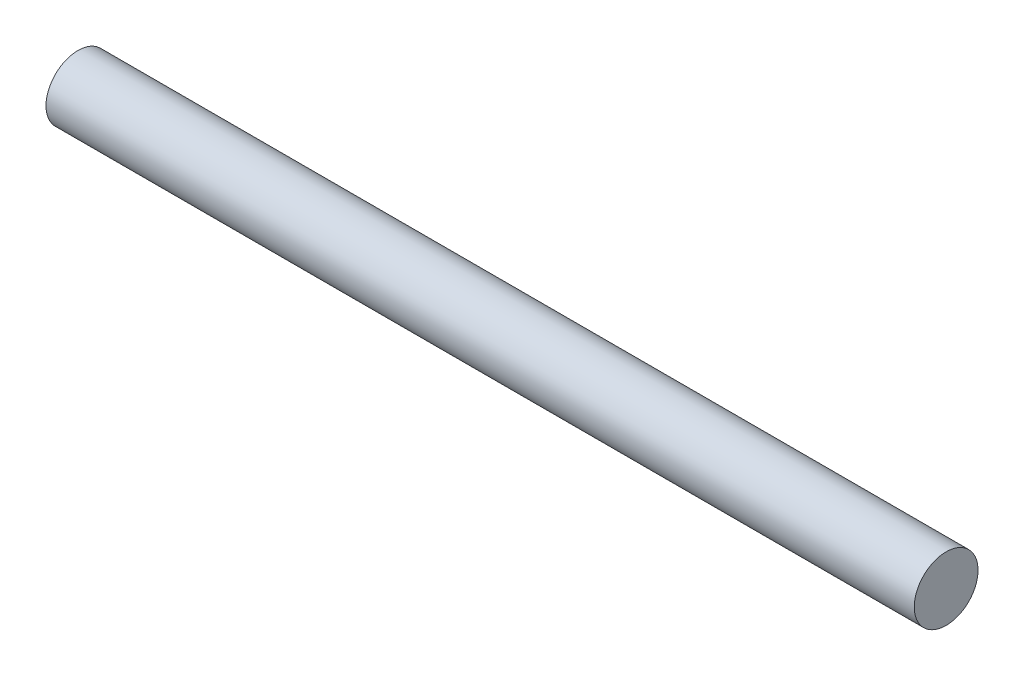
from build123d import *

# Parameters (mm, degrees)
SKETCH1_R           = 1.4
BOSS_EXTRUDE1_DEPTH = 38.1


with BuildPart() as part:
    # Sketch1 → Boss-Extrude1 (new body)
    with BuildSketch(Plane(origin=(0, 0, 0), x_dir=(0, 0, -1), z_dir=(1, 0, 0))):
        with Locations(Location((0, 0, 0), (0, 0, 180))):
            Circle(SKETCH1_R)
    extrude(amount=BOSS_EXTRUDE1_DEPTH)


solid = part.part
